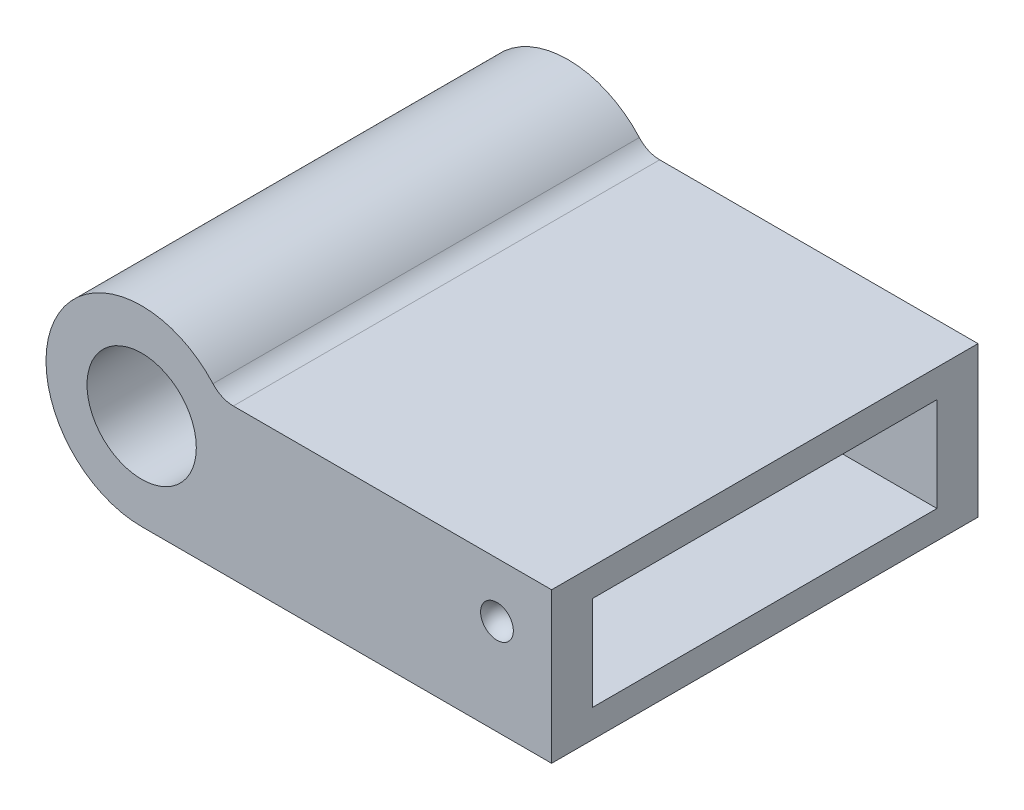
from build123d import *

# Parameters (mm, degrees)
BOSS_EXTRU_1_DEPTH      = 7.8
ESQUISSE2_W             = 12.6
ESQUISSE2_H             = 3.45
ENL_V_MAT_EXTRU_1_DEPTH = 8.6
ESQUISSE3_R             = 2
ENL_V_MAT_EXTRU_2_DEPTH = 10
CONG_1_R                = 1


with BuildPart() as part:
    # Esquisse1 → Boss.-Extru.1 (new, symmetric)
    with BuildSketch(Plane.XY):
        with BuildLine():
            Line((2.872281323, 2), (15, 2))
            Line((15, 2), (15, -3.5))
            Line((15, -3.5), (0, -3.5))
            ThreePointArc((0, -3.5), (-3.102418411, 1.620185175), (2.872281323, 2))
        make_face()
    extrude(amount=BOSS_EXTRU_1_DEPTH, both=True)

    # Esquisse2 → Enl_v. mat.-Extru.1 (cut)
    with BuildSketch(Plane(origin=(15, 0, 0), x_dir=(0, 0, -1), z_dir=(1, 0, 0))):
        with Locations((0, -0.75)):
            Rectangle(ESQUISSE2_W, ESQUISSE2_H)
    extrude(amount=-ENL_V_MAT_EXTRU_1_DEPTH, mode=Mode.SUBTRACT)

    # Esquisse3 → Enl_v. mat.-Extru.2 (cut, symmetric)
    with BuildSketch(Plane.XY):
        Circle(ESQUISSE3_R)
    extrude(amount=ENL_V_MAT_EXTRU_2_DEPTH, both=True, mode=Mode.SUBTRACT)

    # Cong_1
    cong_1_edges = [part.edges().sort_by_distance(p)[0] for p in [
        (2.872281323, 2, 0),
    ]]
    fillet(cong_1_edges, radius=CONG_1_R)

    # Esquisse4 → Enl_vement de mati_re-R_volution1 (revolve, cut)
    with BuildSketch(Plane(origin=(0, 0, 0), x_dir=(1, 0, 0), z_dir=(0, 1, 0))):
        with BuildLine():
            Line((13, 8.422148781), (13, 7.222148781))
            ThreePointArc((13, 7.222148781), (12.4, 7.822148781), (13, 8.422148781))
        make_face()
        with BuildLine():
            Line((13, -7.222148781), (13, -8.422148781))
            ThreePointArc((13, -8.422148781), (12.4, -7.822148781), (13, -7.222148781))
        make_face()
    revolve(axis=Axis((13, 0, -8.839028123), (0, 0, 1)), mode=Mode.SUBTRACT)


solid = part.part
